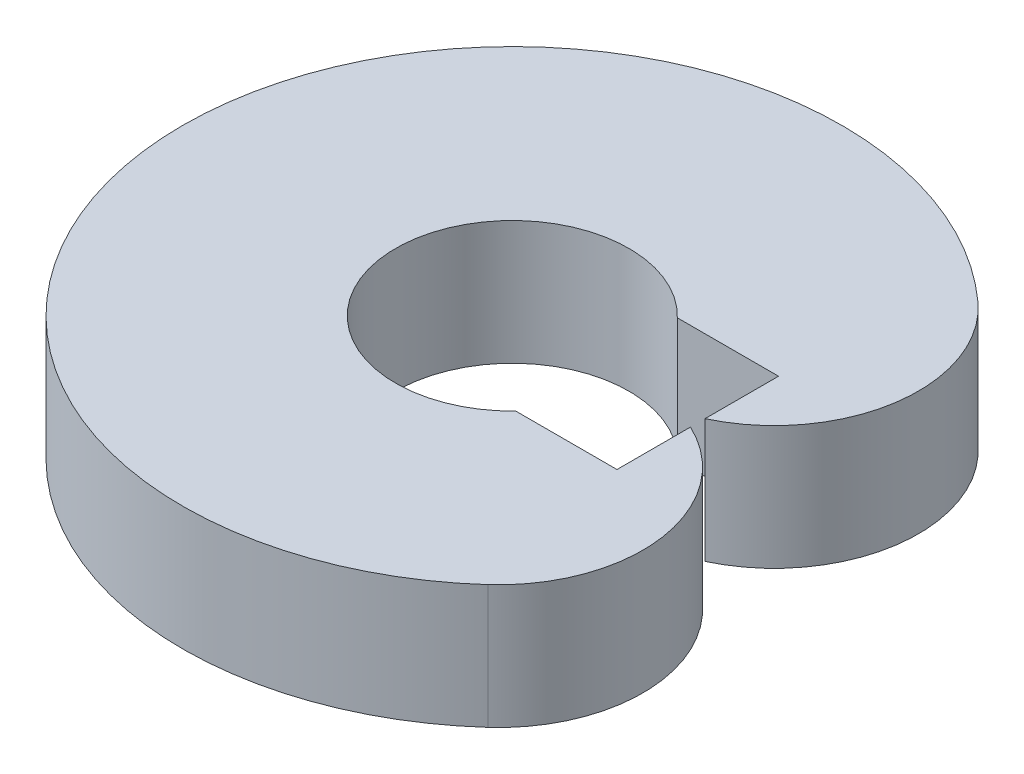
ISO-10303-21;
HEADER;
FILE_DESCRIPTION(('STEP AP214'),'2;1');
FILE_NAME('part.step','',(''),(''),'','','');
FILE_SCHEMA(('AUTOMOTIVE_DESIGN { 1 0 10303 214 1 1 1 1 }'));
ENDSEC;
DATA;
#1=APPLICATION_CONTEXT('core data for automotive mechanical design processes');
#2=APPLICATION_PROTOCOL_DEFINITION('international standard','automotive_design',2000,#1);
#3=PRODUCT_CONTEXT('',#1,'mechanical');
#4=PRODUCT('Part','Part','',(#3));
#5=PRODUCT_RELATED_PRODUCT_CATEGORY('part','',(#4));
#6=PRODUCT_DEFINITION_FORMATION('','',#4);
#7=PRODUCT_DEFINITION_CONTEXT('part definition',#1,'design');
#8=PRODUCT_DEFINITION('design','',#6,#7);
#9=PRODUCT_DEFINITION_SHAPE('','',#8);
#10=(LENGTH_UNIT() NAMED_UNIT(*) SI_UNIT(.MILLI.,.METRE.));
#11=(NAMED_UNIT(*) PLANE_ANGLE_UNIT() SI_UNIT($,.RADIAN.));
#12=(NAMED_UNIT(*) SI_UNIT($,.STERADIAN.) SOLID_ANGLE_UNIT());
#13=UNCERTAINTY_MEASURE_WITH_UNIT(LENGTH_MEASURE(1.E-05),#10,'distance_accuracy_value','');
#14=(GEOMETRIC_REPRESENTATION_CONTEXT(3) GLOBAL_UNCERTAINTY_ASSIGNED_CONTEXT((#13)) GLOBAL_UNIT_ASSIGNED_CONTEXT((#10,
#11,#12)) REPRESENTATION_CONTEXT('',''));
#15=CARTESIAN_POINT('',(0.,0.,0.));
#16=DIRECTION('',(0.,0.,1.));
#17=DIRECTION('',(1.,0.,0.));
#18=AXIS2_PLACEMENT_3D('',#15,#16,#17);
#19=CARTESIAN_POINT('',(72.4264189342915,150.,98.));
#20=DIRECTION('',(0.,0.,1.));
#21=DIRECTION('',(1.,0.,0.));
#22=AXIS2_PLACEMENT_3D('',#19,#20,#21);
#23=PLANE('',#22);
#24=DIRECTION('',(0.,1.,0.));
#25=VECTOR('',#24,1.);
#26=CARTESIAN_POINT('',(102.208414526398,150.,98.));
#27=LINE('',#26,#25);
#28=CARTESIAN_POINT('',(102.208414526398,0.,98.));
#29=VERTEX_POINT('',#28);
#30=CARTESIAN_POINT('',(102.208414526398,150.,98.));
#31=VERTEX_POINT('',#30);
#32=EDGE_CURVE('E122',#29,#31,#27,.T.);
#33=ORIENTED_EDGE('',*,*,#32,.T.);
#34=DIRECTION('',(-1.,0.,0.));
#35=VECTOR('',#34,1.);
#36=CARTESIAN_POINT('',(72.4264189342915,150.,98.));
#37=LINE('',#36,#35);
#38=CARTESIAN_POINT('',(225.,150.,98.));
#39=VERTEX_POINT('',#38);
#40=EDGE_CURVE('E107',#39,#31,#37,.T.);
#41=ORIENTED_EDGE('',*,*,#40,.F.);
#42=DIRECTION('',(0.,-1.,0.));
#43=VECTOR('',#42,1.);
#44=CARTESIAN_POINT('',(225.,150.,98.));
#45=LINE('',#44,#43);
#46=CARTESIAN_POINT('',(225.,0.,98.));
#47=VERTEX_POINT('',#46);
#48=EDGE_CURVE('E10',#39,#47,#45,.T.);
#49=ORIENTED_EDGE('',*,*,#48,.T.);
#50=DIRECTION('',(-1.,0.,0.));
#51=VECTOR('',#50,1.);
#52=CARTESIAN_POINT('',(72.4264189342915,0.,98.));
#53=LINE('',#52,#51);
#54=EDGE_CURVE('E127',#47,#29,#53,.T.);
#55=ORIENTED_EDGE('',*,*,#54,.T.);
#56=EDGE_LOOP('',(#33,#41,#49,#55));
#57=FACE_BOUND('',#56,.T.);
#58=ADVANCED_FACE('F15',(#57),#23,.F.);
#59=CARTESIAN_POINT('',(225.,150.,98.));
#60=DIRECTION('',(1.,0.,0.));
#61=DIRECTION('',(0.,1.,0.));
#62=AXIS2_PLACEMENT_3D('',#59,#60,#61);
#63=PLANE('',#62);
#64=DIRECTION('',(0.,0.,-1.));
#65=VECTOR('',#64,1.);
#66=CARTESIAN_POINT('',(225.,0.,0.));
#67=LINE('',#66,#65);
#68=CARTESIAN_POINT('',(225.,0.,8.8319227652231));
#69=VERTEX_POINT('',#68);
#70=EDGE_CURVE('E166',#47,#69,#67,.T.);
#71=ORIENTED_EDGE('',*,*,#70,.F.);
#72=ORIENTED_EDGE('',*,*,#48,.F.);
#73=DIRECTION('',(0.,0.,1.));
#74=VECTOR('',#73,1.);
#75=CARTESIAN_POINT('',(225.,150.,98.));
#76=LINE('',#75,#74);
#77=CARTESIAN_POINT('',(225.,150.,8.8319227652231));
#78=VERTEX_POINT('',#77);
#79=EDGE_CURVE('E113',#78,#39,#76,.T.);
#80=ORIENTED_EDGE('',*,*,#79,.F.);
#81=DIRECTION('',(0.,1.,0.));
#82=VECTOR('',#81,1.);
#83=CARTESIAN_POINT('',(225.,150.,8.8319227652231));
#84=LINE('',#83,#82);
#85=EDGE_CURVE('E148',#69,#78,#84,.T.);
#86=ORIENTED_EDGE('',*,*,#85,.F.);
#87=EDGE_LOOP('',(#71,#72,#80,#86));
#88=FACE_BOUND('',#87,.T.);
#89=ADVANCED_FACE('F268',(#88),#63,.F.);
#90=CARTESIAN_POINT('',(225.,150.,98.));
#91=DIRECTION('',(1.,0.,0.));
#92=DIRECTION('',(0.,1.,0.));
#93=AXIS2_PLACEMENT_3D('',#90,#91,#92);
#94=PLANE('',#93);
#95=DIRECTION('',(0.,0.,1.));
#96=VECTOR('',#95,1.);
#97=CARTESIAN_POINT('',(225.,150.,98.));
#98=LINE('',#97,#96);
#99=CARTESIAN_POINT('',(225.,150.,-98.));
#100=VERTEX_POINT('',#99);
#101=CARTESIAN_POINT('',(225.,150.,-8.83192276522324));
#102=VERTEX_POINT('',#101);
#103=EDGE_CURVE('E174',#100,#102,#98,.T.);
#104=ORIENTED_EDGE('',*,*,#103,.F.);
#105=DIRECTION('',(0.,-1.,0.));
#106=VECTOR('',#105,1.);
#107=CARTESIAN_POINT('',(225.,150.,-98.));
#108=LINE('',#107,#106);
#109=CARTESIAN_POINT('',(225.,0.,-98.));
#110=VERTEX_POINT('',#109);
#111=EDGE_CURVE('E25',#100,#110,#108,.T.);
#112=ORIENTED_EDGE('',*,*,#111,.T.);
#113=DIRECTION('',(0.,0.,1.));
#114=VECTOR('',#113,1.);
#115=CARTESIAN_POINT('',(225.,0.,98.));
#116=LINE('',#115,#114);
#117=CARTESIAN_POINT('',(225.,0.,-8.83192276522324));
#118=VERTEX_POINT('',#117);
#119=EDGE_CURVE('E171',#110,#118,#116,.T.);
#120=ORIENTED_EDGE('',*,*,#119,.T.);
#121=DIRECTION('',(0.,-1.,0.));
#122=VECTOR('',#121,1.);
#123=CARTESIAN_POINT('',(225.,150.,-8.83192276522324));
#124=LINE('',#123,#122);
#125=EDGE_CURVE('E18',#102,#118,#124,.T.);
#126=ORIENTED_EDGE('',*,*,#125,.F.);
#127=EDGE_LOOP('',(#104,#112,#120,#126));
#128=FACE_BOUND('',#127,.T.);
#129=ADVANCED_FACE('F270',(#128),#94,.F.);
#130=CARTESIAN_POINT('',(72.4264189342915,150.,-98.));
#131=DIRECTION('',(0.,0.,-1.));
#132=DIRECTION('',(0.,-1.,0.));
#133=AXIS2_PLACEMENT_3D('',#130,#131,#132);
#134=PLANE('',#133);
#135=DIRECTION('',(0.,-1.,0.));
#136=VECTOR('',#135,1.);
#137=CARTESIAN_POINT('',(102.208414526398,150.,-98.));
#138=LINE('',#137,#136);
#139=CARTESIAN_POINT('',(102.208414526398,150.,-98.));
#140=VERTEX_POINT('',#139);
#141=CARTESIAN_POINT('',(102.208414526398,0.,-98.));
#142=VERTEX_POINT('',#141);
#143=EDGE_CURVE('E123',#140,#142,#138,.T.);
#144=ORIENTED_EDGE('',*,*,#143,.T.);
#145=DIRECTION('',(-1.,0.,0.));
#146=VECTOR('',#145,1.);
#147=CARTESIAN_POINT('',(0.,0.,-98.));
#148=LINE('',#147,#146);
#149=EDGE_CURVE('E164',#110,#142,#148,.T.);
#150=ORIENTED_EDGE('',*,*,#149,.F.);
#151=ORIENTED_EDGE('',*,*,#111,.F.);
#152=DIRECTION('',(1.,0.,0.));
#153=VECTOR('',#152,1.);
#154=CARTESIAN_POINT('',(72.4264189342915,150.,-98.));
#155=LINE('',#154,#153);
#156=EDGE_CURVE('E92',#140,#100,#155,.T.);
#157=ORIENTED_EDGE('',*,*,#156,.F.);
#158=EDGE_LOOP('',(#144,#150,#151,#157));
#159=FACE_BOUND('',#158,.T.);
#160=ADVANCED_FACE('F277',(#159),#134,.F.);
#161=CARTESIAN_POINT('',(0.,0.,0.));
#162=DIRECTION('',(0.,1.,0.));
#163=DIRECTION('',(1.,0.,0.));
#164=AXIS2_PLACEMENT_3D('',#161,#162,#163);
#165=PLANE('',#164);
#166=CARTESIAN_POINT('',(0.,0.,0.));
#167=DIRECTION('',(0.,1.,0.));
#168=DIRECTION('',(0.,0.,1.));
#169=AXIS2_PLACEMENT_3D('',#166,#167,#168);
#170=CIRCLE('',#169,141.6);
#171=EDGE_CURVE('E130',#142,#29,#170,.T.);
#172=ORIENTED_EDGE('',*,*,#171,.T.);
#173=ORIENTED_EDGE('',*,*,#54,.F.);
#174=ORIENTED_EDGE('',*,*,#70,.T.);
#175=CARTESIAN_POINT('',(150.554386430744,0.,167.207585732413));
#176=DIRECTION('',(0.,1.,0.));
#177=DIRECTION('',(0.,0.,1.));
#178=AXIS2_PLACEMENT_3D('',#175,#176,#177);
#179=CIRCLE('',#178,175.);
#180=CARTESIAN_POINT('',(267.652242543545,0.,297.257930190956));
#181=VERTEX_POINT('',#180);
#182=EDGE_CURVE('E145',#181,#69,#179,.T.);
#183=ORIENTED_EDGE('',*,*,#182,.F.);
#184=CARTESIAN_POINT('',(0.,0.,0.));
#185=DIRECTION('',(0.,1.,0.));
#186=DIRECTION('',(0.,0.,1.));
#187=AXIS2_PLACEMENT_3D('',#184,#185,#186);
#188=CIRCLE('',#187,400.);
#189=CARTESIAN_POINT('',(267.652242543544,0.,-297.257930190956));
#190=VERTEX_POINT('',#189);
#191=EDGE_CURVE('E140',#190,#181,#188,.T.);
#192=ORIENTED_EDGE('',*,*,#191,.F.);
#193=CARTESIAN_POINT('',(150.554386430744,0.,-167.207585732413));
#194=DIRECTION('',(0.,1.,0.));
#195=DIRECTION('',(0.,0.,1.));
#196=AXIS2_PLACEMENT_3D('',#193,#194,#195);
#197=CIRCLE('',#196,175.);
#198=EDGE_CURVE('E162',#118,#190,#197,.T.);
#199=ORIENTED_EDGE('',*,*,#198,.F.);
#200=ORIENTED_EDGE('',*,*,#119,.F.);
#201=ORIENTED_EDGE('',*,*,#149,.T.);
#202=EDGE_LOOP('',(#172,#173,#174,#183,#192,#199,#200,#201));
#203=FACE_BOUND('',#202,.T.);
#204=ADVANCED_FACE('F221',(#203),#165,.F.);
#205=CARTESIAN_POINT('',(0.,150.,0.));
#206=DIRECTION('',(0.,1.,0.));
#207=DIRECTION('',(1.,0.,0.));
#208=AXIS2_PLACEMENT_3D('',#205,#206,#207);
#209=PLANE('',#208);
#210=ORIENTED_EDGE('',*,*,#40,.T.);
#211=CARTESIAN_POINT('',(0.,150.,0.));
#212=DIRECTION('',(0.,1.,0.));
#213=DIRECTION('',(0.,0.,1.));
#214=AXIS2_PLACEMENT_3D('',#211,#212,#213);
#215=CIRCLE('',#214,141.6);
#216=EDGE_CURVE('E110',#140,#31,#215,.T.);
#217=ORIENTED_EDGE('',*,*,#216,.F.);
#218=ORIENTED_EDGE('',*,*,#156,.T.);
#219=ORIENTED_EDGE('',*,*,#103,.T.);
#220=CARTESIAN_POINT('',(150.554386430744,150.,-167.207585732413));
#221=DIRECTION('',(0.,1.,0.));
#222=DIRECTION('',(0.,0.,1.));
#223=AXIS2_PLACEMENT_3D('',#220,#221,#222);
#224=CIRCLE('',#223,175.);
#225=CARTESIAN_POINT('',(267.652242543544,150.,-297.257930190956));
#226=VERTEX_POINT('',#225);
#227=EDGE_CURVE('E153',#102,#226,#224,.T.);
#228=ORIENTED_EDGE('',*,*,#227,.T.);
#229=CARTESIAN_POINT('',(0.,150.,0.));
#230=DIRECTION('',(0.,1.,0.));
#231=DIRECTION('',(0.,0.,1.));
#232=AXIS2_PLACEMENT_3D('',#229,#230,#231);
#233=CIRCLE('',#232,400.);
#234=CARTESIAN_POINT('',(267.652242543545,150.,297.257930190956));
#235=VERTEX_POINT('',#234);
#236=EDGE_CURVE('E131',#226,#235,#233,.T.);
#237=ORIENTED_EDGE('',*,*,#236,.T.);
#238=CARTESIAN_POINT('',(150.554386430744,150.,167.207585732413));
#239=DIRECTION('',(0.,1.,0.));
#240=DIRECTION('',(0.,0.,1.));
#241=AXIS2_PLACEMENT_3D('',#238,#239,#240);
#242=CIRCLE('',#241,175.);
#243=EDGE_CURVE('E154',#235,#78,#242,.T.);
#244=ORIENTED_EDGE('',*,*,#243,.T.);
#245=ORIENTED_EDGE('',*,*,#79,.T.);
#246=EDGE_LOOP('',(#210,#217,#218,#219,#228,#237,#244,#245));
#247=FACE_BOUND('',#246,.T.);
#248=ADVANCED_FACE('F109',(#247),#209,.T.);
#249=CARTESIAN_POINT('',(0.,150.,0.));
#250=DIRECTION('',(0.,-1.,0.));
#251=DIRECTION('',(0.,0.,-1.));
#252=AXIS2_PLACEMENT_3D('',#249,#250,#251);
#253=CYLINDRICAL_SURFACE('',#252,141.6);
#254=ORIENTED_EDGE('',*,*,#32,.F.);
#255=ORIENTED_EDGE('',*,*,#171,.F.);
#256=ORIENTED_EDGE('',*,*,#143,.F.);
#257=ORIENTED_EDGE('',*,*,#216,.T.);
#258=EDGE_LOOP('',(#254,#255,#256,#257));
#259=FACE_BOUND('',#258,.T.);
#260=ADVANCED_FACE('F120',(#259),#253,.F.);
#261=CARTESIAN_POINT('',(0.,150.,0.));
#262=DIRECTION('',(0.,-1.,0.));
#263=DIRECTION('',(0.,0.,-1.));
#264=AXIS2_PLACEMENT_3D('',#261,#262,#263);
#265=CYLINDRICAL_SURFACE('',#264,400.);
#266=ORIENTED_EDGE('',*,*,#191,.T.);
#267=DIRECTION('',(0.,-1.,0.));
#268=VECTOR('',#267,1.);
#269=CARTESIAN_POINT('',(267.652242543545,150.,297.257930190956));
#270=LINE('',#269,#268);
#271=EDGE_CURVE('E149',#235,#181,#270,.T.);
#272=ORIENTED_EDGE('',*,*,#271,.F.);
#273=ORIENTED_EDGE('',*,*,#236,.F.);
#274=DIRECTION('',(0.,-1.,0.));
#275=VECTOR('',#274,1.);
#276=CARTESIAN_POINT('',(267.652242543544,150.,-297.257930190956));
#277=LINE('',#276,#275);
#278=EDGE_CURVE('E158',#226,#190,#277,.T.);
#279=ORIENTED_EDGE('',*,*,#278,.T.);
#280=EDGE_LOOP('',(#266,#272,#273,#279));
#281=FACE_BOUND('',#280,.T.);
#282=ADVANCED_FACE('F215',(#281),#265,.T.);
#283=CARTESIAN_POINT('',(150.554386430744,150.,-167.207585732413));
#284=DIRECTION('',(0.,-1.,0.));
#285=DIRECTION('',(0.,0.,-1.));
#286=AXIS2_PLACEMENT_3D('',#283,#284,#285);
#287=CYLINDRICAL_SURFACE('',#286,175.);
#288=ORIENTED_EDGE('',*,*,#227,.F.);
#289=ORIENTED_EDGE('',*,*,#125,.T.);
#290=ORIENTED_EDGE('',*,*,#198,.T.);
#291=ORIENTED_EDGE('',*,*,#278,.F.);
#292=EDGE_LOOP('',(#288,#289,#290,#291));
#293=FACE_BOUND('',#292,.T.);
#294=ADVANCED_FACE('F213',(#293),#287,.T.);
#295=CARTESIAN_POINT('',(150.554386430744,150.,167.207585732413));
#296=DIRECTION('',(0.,-1.,0.));
#297=DIRECTION('',(0.,0.,-1.));
#298=AXIS2_PLACEMENT_3D('',#295,#296,#297);
#299=CYLINDRICAL_SURFACE('',#298,175.);
#300=ORIENTED_EDGE('',*,*,#182,.T.);
#301=ORIENTED_EDGE('',*,*,#85,.T.);
#302=ORIENTED_EDGE('',*,*,#243,.F.);
#303=ORIENTED_EDGE('',*,*,#271,.T.);
#304=EDGE_LOOP('',(#300,#301,#302,#303));
#305=FACE_BOUND('',#304,.T.);
#306=ADVANCED_FACE('F267',(#305),#299,.T.);
#307=CLOSED_SHELL('',(#58,#89,#129,#160,#204,#248,#260,#282,#294,#306));
#308=MANIFOLD_SOLID_BREP('B1',#307);
#309=ADVANCED_BREP_SHAPE_REPRESENTATION('',(#18,#308),#14);
#310=SHAPE_DEFINITION_REPRESENTATION(#9,#309);
ENDSEC;
END-ISO-10303-21;
